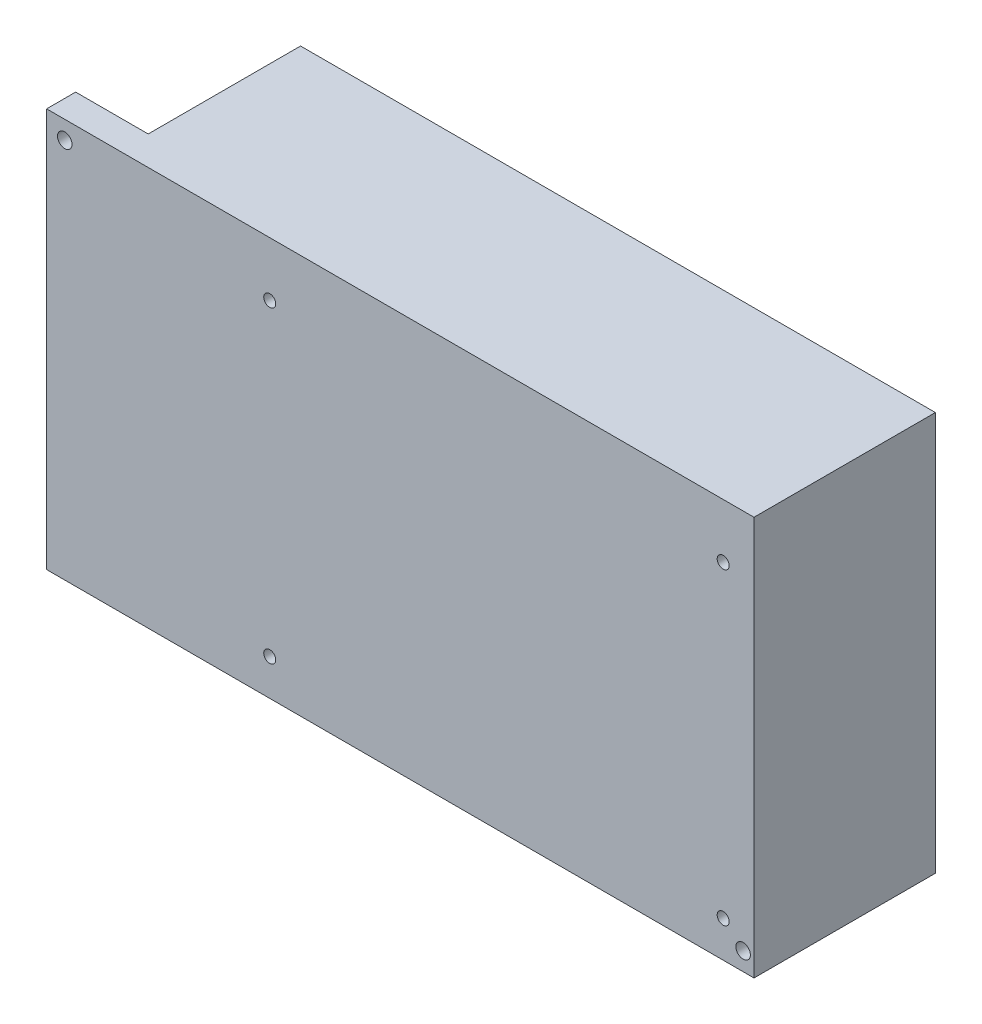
ISO-10303-21;
HEADER;
FILE_DESCRIPTION(('STEP AP214'),'2;1');
FILE_NAME('part.step','',(''),(''),'','','');
FILE_SCHEMA(('AUTOMOTIVE_DESIGN { 1 0 10303 214 1 1 1 1 }'));
ENDSEC;
DATA;
#1=APPLICATION_CONTEXT('core data for automotive mechanical design processes');
#2=APPLICATION_PROTOCOL_DEFINITION('international standard','automotive_design',2000,#1);
#3=PRODUCT_CONTEXT('',#1,'mechanical');
#4=PRODUCT('Part','Part','',(#3));
#5=PRODUCT_RELATED_PRODUCT_CATEGORY('part','',(#4));
#6=PRODUCT_DEFINITION_FORMATION('','',#4);
#7=PRODUCT_DEFINITION_CONTEXT('part definition',#1,'design');
#8=PRODUCT_DEFINITION('design','',#6,#7);
#9=PRODUCT_DEFINITION_SHAPE('','',#8);
#10=(LENGTH_UNIT() NAMED_UNIT(*) SI_UNIT(.MILLI.,.METRE.));
#11=(NAMED_UNIT(*) PLANE_ANGLE_UNIT() SI_UNIT($,.RADIAN.));
#12=(NAMED_UNIT(*) SI_UNIT($,.STERADIAN.) SOLID_ANGLE_UNIT());
#13=UNCERTAINTY_MEASURE_WITH_UNIT(LENGTH_MEASURE(1.E-05),#10,'distance_accuracy_value','');
#14=(GEOMETRIC_REPRESENTATION_CONTEXT(3) GLOBAL_UNCERTAINTY_ASSIGNED_CONTEXT((#13)) GLOBAL_UNIT_ASSIGNED_CONTEXT((#10,
#11,#12)) REPRESENTATION_CONTEXT('',''));
#15=CARTESIAN_POINT('',(0.,0.,0.));
#16=DIRECTION('',(0.,0.,1.));
#17=DIRECTION('',(1.,0.,0.));
#18=AXIS2_PLACEMENT_3D('',#15,#16,#17);
#19=CARTESIAN_POINT('',(0.,0.,50.));
#20=DIRECTION('',(1.,0.,0.));
#21=DIRECTION('',(0.,0.,-1.));
#22=AXIS2_PLACEMENT_3D('',#19,#20,#21);
#23=PLANE('',#22);
#24=DIRECTION('',(0.,0.,-1.));
#25=VECTOR('',#24,1.);
#26=CARTESIAN_POINT('',(0.,110.,50.));
#27=LINE('',#26,#25);
#28=CARTESIAN_POINT('',(0.,110.,50.));
#29=VERTEX_POINT('',#28);
#30=CARTESIAN_POINT('',(0.,110.,42.));
#31=VERTEX_POINT('',#30);
#32=EDGE_CURVE('E209',#29,#31,#27,.T.);
#33=ORIENTED_EDGE('',*,*,#32,.T.);
#34=DIRECTION('',(0.,1.,0.));
#35=VECTOR('',#34,1.);
#36=CARTESIAN_POINT('',(0.,110.,42.));
#37=LINE('',#36,#35);
#38=CARTESIAN_POINT('',(0.,0.,42.));
#39=VERTEX_POINT('',#38);
#40=EDGE_CURVE('E169',#39,#31,#37,.T.);
#41=ORIENTED_EDGE('',*,*,#40,.F.);
#42=DIRECTION('',(0.,0.,-1.));
#43=VECTOR('',#42,1.);
#44=CARTESIAN_POINT('',(0.,0.,50.));
#45=LINE('',#44,#43);
#46=CARTESIAN_POINT('',(0.,0.,50.));
#47=VERTEX_POINT('',#46);
#48=EDGE_CURVE('E11',#47,#39,#45,.T.);
#49=ORIENTED_EDGE('',*,*,#48,.F.);
#50=DIRECTION('',(0.,-1.,0.));
#51=VECTOR('',#50,1.);
#52=CARTESIAN_POINT('',(0.,0.,50.));
#53=LINE('',#52,#51);
#54=EDGE_CURVE('E199',#29,#47,#53,.T.);
#55=ORIENTED_EDGE('',*,*,#54,.F.);
#56=EDGE_LOOP('',(#33,#41,#49,#55));
#57=FACE_BOUND('',#56,.T.);
#58=ADVANCED_FACE('F46',(#57),#23,.F.);
#59=CARTESIAN_POINT('',(0.,0.,50.));
#60=DIRECTION('',(0.,1.,0.));
#61=DIRECTION('',(0.,0.,1.));
#62=AXIS2_PLACEMENT_3D('',#59,#60,#61);
#63=PLANE('',#62);
#64=ORIENTED_EDGE('',*,*,#48,.T.);
#65=DIRECTION('',(-1.,0.,0.));
#66=VECTOR('',#65,1.);
#67=CARTESIAN_POINT('',(20.,0.,42.));
#68=LINE('',#67,#66);
#69=CARTESIAN_POINT('',(20.,0.,42.));
#70=VERTEX_POINT('',#69);
#71=EDGE_CURVE('E182',#70,#39,#68,.T.);
#72=ORIENTED_EDGE('',*,*,#71,.F.);
#73=DIRECTION('',(0.,0.,1.));
#74=VECTOR('',#73,1.);
#75=CARTESIAN_POINT('',(20.,0.,42.));
#76=LINE('',#75,#74);
#77=CARTESIAN_POINT('',(20.,0.,0.));
#78=VERTEX_POINT('',#77);
#79=EDGE_CURVE('E177',#78,#70,#76,.T.);
#80=ORIENTED_EDGE('',*,*,#79,.F.);
#81=DIRECTION('',(1.,0.,0.));
#82=VECTOR('',#81,1.);
#83=CARTESIAN_POINT('',(0.,0.,0.));
#84=LINE('',#83,#82);
#85=CARTESIAN_POINT('',(195.,0.,0.));
#86=VERTEX_POINT('',#85);
#87=EDGE_CURVE('E190',#78,#86,#84,.T.);
#88=ORIENTED_EDGE('',*,*,#87,.T.);
#89=DIRECTION('',(0.,0.,-1.));
#90=VECTOR('',#89,1.);
#91=CARTESIAN_POINT('',(195.,0.,50.));
#92=LINE('',#91,#90);
#93=CARTESIAN_POINT('',(195.,0.,50.));
#94=VERTEX_POINT('',#93);
#95=EDGE_CURVE('E54',#94,#86,#92,.T.);
#96=ORIENTED_EDGE('',*,*,#95,.F.);
#97=DIRECTION('',(1.,0.,0.));
#98=VECTOR('',#97,1.);
#99=CARTESIAN_POINT('',(0.,0.,50.));
#100=LINE('',#99,#98);
#101=EDGE_CURVE('E95',#47,#94,#100,.T.);
#102=ORIENTED_EDGE('',*,*,#101,.F.);
#103=EDGE_LOOP('',(#64,#72,#80,#88,#96,#102));
#104=FACE_BOUND('',#103,.T.);
#105=ADVANCED_FACE('F249',(#104),#63,.F.);
#106=CARTESIAN_POINT('',(195.,0.,50.));
#107=DIRECTION('',(-1.,0.,0.));
#108=DIRECTION('',(0.,0.,1.));
#109=AXIS2_PLACEMENT_3D('',#106,#107,#108);
#110=PLANE('',#109);
#111=DIRECTION('',(0.,1.,0.));
#112=VECTOR('',#111,1.);
#113=CARTESIAN_POINT('',(195.,0.,0.));
#114=LINE('',#113,#112);
#115=CARTESIAN_POINT('',(195.,110.,0.));
#116=VERTEX_POINT('',#115);
#117=EDGE_CURVE('E88',#86,#116,#114,.T.);
#118=ORIENTED_EDGE('',*,*,#117,.T.);
#119=DIRECTION('',(0.,0.,-1.));
#120=VECTOR('',#119,1.);
#121=CARTESIAN_POINT('',(195.,110.,50.));
#122=LINE('',#121,#120);
#123=CARTESIAN_POINT('',(195.,110.,50.));
#124=VERTEX_POINT('',#123);
#125=EDGE_CURVE('E219',#124,#116,#122,.T.);
#126=ORIENTED_EDGE('',*,*,#125,.F.);
#127=DIRECTION('',(0.,1.,0.));
#128=VECTOR('',#127,1.);
#129=CARTESIAN_POINT('',(195.,0.,50.));
#130=LINE('',#129,#128);
#131=EDGE_CURVE('E204',#94,#124,#130,.T.);
#132=ORIENTED_EDGE('',*,*,#131,.F.);
#133=ORIENTED_EDGE('',*,*,#95,.T.);
#134=EDGE_LOOP('',(#118,#126,#132,#133));
#135=FACE_BOUND('',#134,.T.);
#136=ADVANCED_FACE('F223',(#135),#110,.F.);
#137=CARTESIAN_POINT('',(0.,110.,50.));
#138=DIRECTION('',(0.,-1.,0.));
#139=DIRECTION('',(0.,0.,-1.));
#140=AXIS2_PLACEMENT_3D('',#137,#138,#139);
#141=PLANE('',#140);
#142=DIRECTION('',(0.,0.,-1.));
#143=VECTOR('',#142,1.);
#144=CARTESIAN_POINT('',(20.,110.,42.));
#145=LINE('',#144,#143);
#146=CARTESIAN_POINT('',(20.,110.,42.));
#147=VERTEX_POINT('',#146);
#148=CARTESIAN_POINT('',(20.,110.,0.));
#149=VERTEX_POINT('',#148);
#150=EDGE_CURVE('E61',#147,#149,#145,.T.);
#151=ORIENTED_EDGE('',*,*,#150,.F.);
#152=DIRECTION('',(-1.,0.,0.));
#153=VECTOR('',#152,1.);
#154=CARTESIAN_POINT('',(20.,110.,42.));
#155=LINE('',#154,#153);
#156=EDGE_CURVE('E180',#147,#31,#155,.T.);
#157=ORIENTED_EDGE('',*,*,#156,.T.);
#158=ORIENTED_EDGE('',*,*,#32,.F.);
#159=DIRECTION('',(-1.,0.,0.));
#160=VECTOR('',#159,1.);
#161=CARTESIAN_POINT('',(0.,110.,50.));
#162=LINE('',#161,#160);
#163=EDGE_CURVE('E70',#124,#29,#162,.T.);
#164=ORIENTED_EDGE('',*,*,#163,.F.);
#165=ORIENTED_EDGE('',*,*,#125,.T.);
#166=DIRECTION('',(-1.,0.,0.));
#167=VECTOR('',#166,1.);
#168=CARTESIAN_POINT('',(0.,110.,0.));
#169=LINE('',#168,#167);
#170=EDGE_CURVE('E201',#116,#149,#169,.T.);
#171=ORIENTED_EDGE('',*,*,#170,.T.);
#172=EDGE_LOOP('',(#151,#157,#158,#164,#165,#171));
#173=FACE_BOUND('',#172,.T.);
#174=ADVANCED_FACE('F229',(#173),#141,.F.);
#175=CARTESIAN_POINT('',(0.,0.,50.));
#176=DIRECTION('',(0.,0.,-1.));
#177=DIRECTION('',(-1.,0.,0.));
#178=AXIS2_PLACEMENT_3D('',#175,#176,#177);
#179=PLANE('',#178);
#180=CARTESIAN_POINT('',(186.5,9.99999999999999,50.));
#181=DIRECTION('',(0.,0.,1.));
#182=DIRECTION('',(1.,0.,0.));
#183=AXIS2_PLACEMENT_3D('',#180,#181,#182);
#184=CIRCLE('',#183,1.64999999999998);
#185=CARTESIAN_POINT('',(188.15,9.99999999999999,50.));
#186=VERTEX_POINT('',#185);
#187=EDGE_CURVE('E139',#186,#186,#184,.T.);
#188=ORIENTED_EDGE('',*,*,#187,.F.);
#189=EDGE_LOOP('',(#188));
#190=FACE_BOUND('',#189,.T.);
#191=CARTESIAN_POINT('',(186.5,95.,50.));
#192=DIRECTION('',(0.,0.,1.));
#193=DIRECTION('',(1.,0.,0.));
#194=AXIS2_PLACEMENT_3D('',#191,#192,#193);
#195=CIRCLE('',#194,1.64999999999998);
#196=CARTESIAN_POINT('',(188.15,95.,50.));
#197=VERTEX_POINT('',#196);
#198=EDGE_CURVE('E138',#197,#197,#195,.T.);
#199=ORIENTED_EDGE('',*,*,#198,.F.);
#200=EDGE_LOOP('',(#199));
#201=FACE_BOUND('',#200,.T.);
#202=CARTESIAN_POINT('',(61.5,95.,50.));
#203=DIRECTION('',(0.,0.,1.));
#204=DIRECTION('',(1.,0.,0.));
#205=AXIS2_PLACEMENT_3D('',#202,#203,#204);
#206=CIRCLE('',#205,1.65);
#207=CARTESIAN_POINT('',(63.15,95.,50.));
#208=VERTEX_POINT('',#207);
#209=EDGE_CURVE('E154',#208,#208,#206,.T.);
#210=ORIENTED_EDGE('',*,*,#209,.F.);
#211=EDGE_LOOP('',(#210));
#212=FACE_BOUND('',#211,.T.);
#213=CARTESIAN_POINT('',(61.5,9.99999999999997,50.));
#214=DIRECTION('',(0.,0.,1.));
#215=DIRECTION('',(1.,0.,0.));
#216=AXIS2_PLACEMENT_3D('',#213,#214,#215);
#217=CIRCLE('',#216,1.65);
#218=CARTESIAN_POINT('',(63.15,9.99999999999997,50.));
#219=VERTEX_POINT('',#218);
#220=EDGE_CURVE('E162',#219,#219,#217,.T.);
#221=ORIENTED_EDGE('',*,*,#220,.F.);
#222=EDGE_LOOP('',(#221));
#223=FACE_BOUND('',#222,.T.);
#224=CARTESIAN_POINT('',(5.,105.,50.));
#225=DIRECTION('',(0.,0.,1.));
#226=DIRECTION('',(1.,0.,0.));
#227=AXIS2_PLACEMENT_3D('',#224,#225,#226);
#228=CIRCLE('',#227,2.);
#229=CARTESIAN_POINT('',(7.,105.,50.));
#230=VERTEX_POINT('',#229);
#231=EDGE_CURVE('E187',#230,#230,#228,.T.);
#232=ORIENTED_EDGE('',*,*,#231,.F.);
#233=EDGE_LOOP('',(#232));
#234=FACE_BOUND('',#233,.T.);
#235=CARTESIAN_POINT('',(192.,5.,50.));
#236=DIRECTION('',(0.,0.,1.));
#237=DIRECTION('',(1.,0.,0.));
#238=AXIS2_PLACEMENT_3D('',#235,#236,#237);
#239=CIRCLE('',#238,2.);
#240=CARTESIAN_POINT('',(194.,5.,50.));
#241=VERTEX_POINT('',#240);
#242=EDGE_CURVE('E195',#241,#241,#239,.T.);
#243=ORIENTED_EDGE('',*,*,#242,.F.);
#244=EDGE_LOOP('',(#243));
#245=FACE_BOUND('',#244,.T.);
#246=ORIENTED_EDGE('',*,*,#54,.T.);
#247=ORIENTED_EDGE('',*,*,#101,.T.);
#248=ORIENTED_EDGE('',*,*,#131,.T.);
#249=ORIENTED_EDGE('',*,*,#163,.T.);
#250=EDGE_LOOP('',(#246,#247,#248,#249));
#251=FACE_BOUND('',#250,.T.);
#252=ADVANCED_FACE('F234',(#190,#201,#212,#223,#234,#245,#251),#179,.F.);
#253=CARTESIAN_POINT('',(0.,0.,0.));
#254=DIRECTION('',(0.,0.,-1.));
#255=DIRECTION('',(-1.,0.,0.));
#256=AXIS2_PLACEMENT_3D('',#253,#254,#255);
#257=PLANE('',#256);
#258=DIRECTION('',(0.,-1.,0.));
#259=VECTOR('',#258,1.);
#260=CARTESIAN_POINT('',(20.,110.,0.));
#261=LINE('',#260,#259);
#262=EDGE_CURVE('E175',#149,#78,#261,.T.);
#263=ORIENTED_EDGE('',*,*,#262,.F.);
#264=ORIENTED_EDGE('',*,*,#170,.F.);
#265=ORIENTED_EDGE('',*,*,#117,.F.);
#266=ORIENTED_EDGE('',*,*,#87,.F.);
#267=EDGE_LOOP('',(#263,#264,#265,#266));
#268=FACE_BOUND('',#267,.T.);
#269=ADVANCED_FACE('F227',(#268),#257,.T.);
#270=CARTESIAN_POINT('',(192.,5.,40.));
#271=DIRECTION('',(0.,0.,1.));
#272=DIRECTION('',(1.,0.,0.));
#273=AXIS2_PLACEMENT_3D('',#270,#271,#272);
#274=CYLINDRICAL_SURFACE('',#273,2.);
#275=CARTESIAN_POINT('',(192.,5.,40.));
#276=DIRECTION('',(0.,0.,1.));
#277=DIRECTION('',(1.,0.,0.));
#278=AXIS2_PLACEMENT_3D('',#275,#276,#277);
#279=CIRCLE('',#278,2.);
#280=CARTESIAN_POINT('',(194.,5.,40.));
#281=VERTEX_POINT('',#280);
#282=EDGE_CURVE('E191',#281,#281,#279,.T.);
#283=ORIENTED_EDGE('',*,*,#282,.F.);
#284=EDGE_LOOP('',(#283));
#285=FACE_BOUND('',#284,.T.);
#286=ORIENTED_EDGE('',*,*,#242,.T.);
#287=EDGE_LOOP('',(#286));
#288=FACE_BOUND('',#287,.T.);
#289=ADVANCED_FACE('F242',(#285,#288),#274,.F.);
#290=CARTESIAN_POINT('',(192.,5.,40.));
#291=DIRECTION('',(0.,0.,1.));
#292=DIRECTION('',(1.,0.,0.));
#293=AXIS2_PLACEMENT_3D('',#290,#291,#292);
#294=PLANE('',#293);
#295=ORIENTED_EDGE('',*,*,#282,.T.);
#296=EDGE_LOOP('',(#295));
#297=FACE_BOUND('',#296,.T.);
#298=ADVANCED_FACE('F279',(#297),#294,.T.);
#299=CARTESIAN_POINT('',(5.,105.,40.));
#300=DIRECTION('',(0.,0.,1.));
#301=DIRECTION('',(1.,0.,0.));
#302=AXIS2_PLACEMENT_3D('',#299,#300,#301);
#303=CYLINDRICAL_SURFACE('',#302,2.);
#304=CARTESIAN_POINT('',(5.,105.,42.));
#305=DIRECTION('',(0.,0.,1.));
#306=DIRECTION('',(0.,-1.,0.));
#307=AXIS2_PLACEMENT_3D('',#304,#305,#306);
#308=CIRCLE('',#307,2.);
#309=CARTESIAN_POINT('',(5.,103.,42.));
#310=VERTEX_POINT('',#309);
#311=EDGE_CURVE('E49',#310,#310,#308,.F.);
#312=ORIENTED_EDGE('',*,*,#311,.T.);
#313=EDGE_LOOP('',(#312));
#314=FACE_BOUND('',#313,.T.);
#315=ORIENTED_EDGE('',*,*,#231,.T.);
#316=EDGE_LOOP('',(#315));
#317=FACE_BOUND('',#316,.T.);
#318=ADVANCED_FACE('F273',(#314,#317),#303,.F.);
#319=CARTESIAN_POINT('',(20.,110.,42.));
#320=DIRECTION('',(0.,0.,1.));
#321=DIRECTION('',(0.,-1.,0.));
#322=AXIS2_PLACEMENT_3D('',#319,#320,#321);
#323=PLANE('',#322);
#324=ORIENTED_EDGE('',*,*,#40,.T.);
#325=ORIENTED_EDGE('',*,*,#156,.F.);
#326=DIRECTION('',(0.,1.,0.));
#327=VECTOR('',#326,1.);
#328=CARTESIAN_POINT('',(20.,110.,42.));
#329=LINE('',#328,#327);
#330=EDGE_CURVE('E170',#70,#147,#329,.T.);
#331=ORIENTED_EDGE('',*,*,#330,.F.);
#332=ORIENTED_EDGE('',*,*,#71,.T.);
#333=EDGE_LOOP('',(#324,#325,#331,#332));
#334=FACE_BOUND('',#333,.T.);
#335=ORIENTED_EDGE('',*,*,#311,.F.);
#336=EDGE_LOOP('',(#335));
#337=FACE_BOUND('',#336,.T.);
#338=ADVANCED_FACE('F260',(#334,#337),#323,.F.);
#339=CARTESIAN_POINT('',(20.,0.,0.));
#340=DIRECTION('',(1.,0.,0.));
#341=DIRECTION('',(0.,0.,-1.));
#342=AXIS2_PLACEMENT_3D('',#339,#340,#341);
#343=PLANE('',#342);
#344=ORIENTED_EDGE('',*,*,#330,.T.);
#345=ORIENTED_EDGE('',*,*,#150,.T.);
#346=ORIENTED_EDGE('',*,*,#262,.T.);
#347=ORIENTED_EDGE('',*,*,#79,.T.);
#348=EDGE_LOOP('',(#344,#345,#346,#347));
#349=FACE_BOUND('',#348,.T.);
#350=ADVANCED_FACE('F262',(#349),#343,.F.);
#351=CARTESIAN_POINT('',(61.5,9.99999999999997,39.4914200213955));
#352=DIRECTION('',(0.,0.,1.));
#353=DIRECTION('',(1.,0.,0.));
#354=AXIS2_PLACEMENT_3D('',#351,#352,#353);
#355=CONICAL_SURFACE('',#354,1.65,1.02974425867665);
#356=CARTESIAN_POINT('',(61.5,9.99999999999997,38.5));
#357=VERTEX_POINT('',#356);
#358=VERTEX_LOOP('',#357);
#359=FACE_BOUND('',#358,.T.);
#360=CARTESIAN_POINT('',(61.5,9.99999999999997,39.4914200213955));
#361=DIRECTION('',(0.,0.,1.));
#362=DIRECTION('',(1.,0.,0.));
#363=AXIS2_PLACEMENT_3D('',#360,#361,#362);
#364=CIRCLE('',#363,1.65);
#365=CARTESIAN_POINT('',(63.15,9.99999999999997,39.4914200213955));
#366=VERTEX_POINT('',#365);
#367=EDGE_CURVE('E166',#366,#366,#364,.T.);
#368=ORIENTED_EDGE('',*,*,#367,.T.);
#369=EDGE_LOOP('',(#368));
#370=FACE_BOUND('',#369,.T.);
#371=ADVANCED_FACE('F264',(#359,#370),#355,.F.);
#372=CARTESIAN_POINT('',(61.5,9.99999999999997,50.));
#373=DIRECTION('',(0.,0.,1.));
#374=DIRECTION('',(1.,0.,0.));
#375=AXIS2_PLACEMENT_3D('',#372,#373,#374);
#376=CYLINDRICAL_SURFACE('',#375,1.65);
#377=ORIENTED_EDGE('',*,*,#367,.F.);
#378=EDGE_LOOP('',(#377));
#379=FACE_BOUND('',#378,.T.);
#380=ORIENTED_EDGE('',*,*,#220,.T.);
#381=EDGE_LOOP('',(#380));
#382=FACE_BOUND('',#381,.T.);
#383=ADVANCED_FACE('F270',(#379,#382),#376,.F.);
#384=CARTESIAN_POINT('',(61.5,95.,39.4914200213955));
#385=DIRECTION('',(0.,0.,1.));
#386=DIRECTION('',(1.,0.,0.));
#387=AXIS2_PLACEMENT_3D('',#384,#385,#386);
#388=CONICAL_SURFACE('',#387,1.65,1.02974425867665);
#389=CARTESIAN_POINT('',(61.5,95.,38.5));
#390=VERTEX_POINT('',#389);
#391=VERTEX_LOOP('',#390);
#392=FACE_BOUND('',#391,.T.);
#393=CARTESIAN_POINT('',(61.5,95.,39.4914200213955));
#394=DIRECTION('',(0.,0.,1.));
#395=DIRECTION('',(1.,0.,0.));
#396=AXIS2_PLACEMENT_3D('',#393,#394,#395);
#397=CIRCLE('',#396,1.65);
#398=CARTESIAN_POINT('',(63.15,95.,39.4914200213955));
#399=VERTEX_POINT('',#398);
#400=EDGE_CURVE('E158',#399,#399,#397,.T.);
#401=ORIENTED_EDGE('',*,*,#400,.T.);
#402=EDGE_LOOP('',(#401));
#403=FACE_BOUND('',#402,.T.);
#404=ADVANCED_FACE('F338',(#392,#403),#388,.F.);
#405=CARTESIAN_POINT('',(61.5,95.,50.));
#406=DIRECTION('',(0.,0.,1.));
#407=DIRECTION('',(1.,0.,0.));
#408=AXIS2_PLACEMENT_3D('',#405,#406,#407);
#409=CYLINDRICAL_SURFACE('',#408,1.65);
#410=ORIENTED_EDGE('',*,*,#400,.F.);
#411=EDGE_LOOP('',(#410));
#412=FACE_BOUND('',#411,.T.);
#413=ORIENTED_EDGE('',*,*,#209,.T.);
#414=EDGE_LOOP('',(#413));
#415=FACE_BOUND('',#414,.T.);
#416=ADVANCED_FACE('F348',(#412,#415),#409,.F.);
#417=CARTESIAN_POINT('',(186.5,95.,39.4914200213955));
#418=DIRECTION('',(0.,0.,1.));
#419=DIRECTION('',(1.,0.,0.));
#420=AXIS2_PLACEMENT_3D('',#417,#418,#419);
#421=CONICAL_SURFACE('',#420,1.64999999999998,1.02974425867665);
#422=CARTESIAN_POINT('',(186.5,95.,38.5));
#423=VERTEX_POINT('',#422);
#424=VERTEX_LOOP('',#423);
#425=FACE_BOUND('',#424,.T.);
#426=CARTESIAN_POINT('',(186.5,95.,39.4914200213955));
#427=DIRECTION('',(0.,0.,1.));
#428=DIRECTION('',(1.,0.,0.));
#429=AXIS2_PLACEMENT_3D('',#426,#427,#428);
#430=CIRCLE('',#429,1.64999999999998);
#431=CARTESIAN_POINT('',(188.15,95.,39.4914200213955));
#432=VERTEX_POINT('',#431);
#433=EDGE_CURVE('E145',#432,#432,#430,.T.);
#434=ORIENTED_EDGE('',*,*,#433,.T.);
#435=EDGE_LOOP('',(#434));
#436=FACE_BOUND('',#435,.T.);
#437=ADVANCED_FACE('F358',(#425,#436),#421,.F.);
#438=CARTESIAN_POINT('',(186.5,95.,50.));
#439=DIRECTION('',(0.,0.,1.));
#440=DIRECTION('',(1.,0.,0.));
#441=AXIS2_PLACEMENT_3D('',#438,#439,#440);
#442=CYLINDRICAL_SURFACE('',#441,1.64999999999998);
#443=ORIENTED_EDGE('',*,*,#433,.F.);
#444=EDGE_LOOP('',(#443));
#445=FACE_BOUND('',#444,.T.);
#446=ORIENTED_EDGE('',*,*,#198,.T.);
#447=EDGE_LOOP('',(#446));
#448=FACE_BOUND('',#447,.T.);
#449=ADVANCED_FACE('F131',(#445,#448),#442,.F.);
#450=CARTESIAN_POINT('',(186.5,9.99999999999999,39.4914200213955));
#451=DIRECTION('',(0.,0.,1.));
#452=DIRECTION('',(1.,0.,0.));
#453=AXIS2_PLACEMENT_3D('',#450,#451,#452);
#454=CONICAL_SURFACE('',#453,1.64999999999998,1.02974425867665);
#455=CARTESIAN_POINT('',(186.5,9.99999999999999,38.5));
#456=VERTEX_POINT('',#455);
#457=VERTEX_LOOP('',#456);
#458=FACE_BOUND('',#457,.T.);
#459=CARTESIAN_POINT('',(186.5,9.99999999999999,39.4914200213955));
#460=DIRECTION('',(0.,0.,1.));
#461=DIRECTION('',(1.,0.,0.));
#462=AXIS2_PLACEMENT_3D('',#459,#460,#461);
#463=CIRCLE('',#462,1.64999999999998);
#464=CARTESIAN_POINT('',(188.15,9.99999999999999,39.4914200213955));
#465=VERTEX_POINT('',#464);
#466=EDGE_CURVE('E135',#465,#465,#463,.T.);
#467=ORIENTED_EDGE('',*,*,#466,.T.);
#468=EDGE_LOOP('',(#467));
#469=FACE_BOUND('',#468,.T.);
#470=ADVANCED_FACE('F127',(#458,#469),#454,.F.);
#471=CARTESIAN_POINT('',(186.5,9.99999999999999,50.));
#472=DIRECTION('',(0.,0.,1.));
#473=DIRECTION('',(1.,0.,0.));
#474=AXIS2_PLACEMENT_3D('',#471,#472,#473);
#475=CYLINDRICAL_SURFACE('',#474,1.64999999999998);
#476=ORIENTED_EDGE('',*,*,#466,.F.);
#477=EDGE_LOOP('',(#476));
#478=FACE_BOUND('',#477,.T.);
#479=ORIENTED_EDGE('',*,*,#187,.T.);
#480=EDGE_LOOP('',(#479));
#481=FACE_BOUND('',#480,.T.);
#482=ADVANCED_FACE('F130',(#478,#481),#475,.F.);
#483=CLOSED_SHELL('',(#58,#105,#136,#174,#252,#269,#289,#298,#318,#338,#350,#371,#383,#404,#416,
#437,#449,#470,#482));
#484=MANIFOLD_SOLID_BREP('B2',#483);
#485=ADVANCED_BREP_SHAPE_REPRESENTATION('',(#18,#484),#14);
#486=SHAPE_DEFINITION_REPRESENTATION(#9,#485);
ENDSEC;
END-ISO-10303-21;
